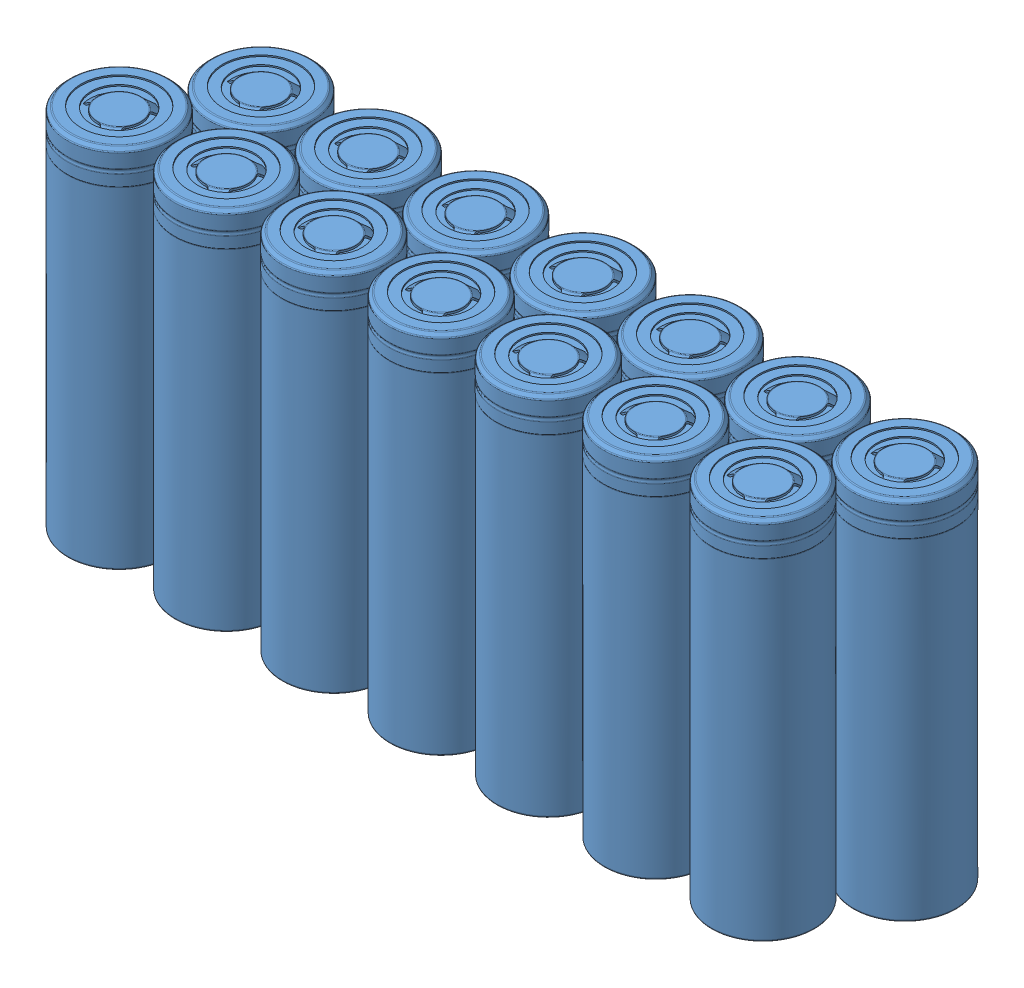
SolidWorks assembly 18650-6s2p_Staggered_v1.SLDASM, configuration Default (file format 12000). Lengths in mm.
Overall size (143.13 64.95 34.95).
14 component instances, 1 part files, 3 mates.
Components (placement in the parent):
- Samsung INR18650-29R-1: Samsung INR18650-29R.SLDPRT [Standard] at (12.9292 41.5757 50.6069) size (18.38 64.95 18.38)
- Samsung INR18650-29R-4: Samsung INR18650-29R.SLDPRT [Standard] at (31.9792 41.5757 50.6069) size (18.38 64.95 18.38)
- Samsung INR18650-29R-5: Samsung INR18650-29R.SLDPRT [Standard] at (51.0292 41.5757 50.6069) size (18.38 64.95 18.38)
- Samsung INR18650-29R-6: Samsung INR18650-29R.SLDPRT [Standard] at (70.0792 41.5757 50.6069) size (18.38 64.95 18.38)
- Samsung INR18650-29R-7: Samsung INR18650-29R.SLDPRT [Standard] at (89.1292 41.5757 50.6069) size (18.38 64.95 18.38)
- Samsung INR18650-29R-8: Samsung INR18650-29R.SLDPRT [Standard] at (108.1792 41.5757 50.6069) size (18.38 64.95 18.38)
- Samsung INR18650-29R-14: Samsung INR18650-29R.SLDPRT [Standard] at (22.4542 41.5757 34.9577) x (0.994386 0 0.105813) z (-0.105813 0 0.994386) size (18.38 64.95 18.38)
- Samsung INR18650-29R-15: Samsung INR18650-29R.SLDPRT [Standard] at (41.5042 41.5757 34.9577) x (0.994386 0 0.105813) z (-0.105813 0 0.994386) size (18.38 64.95 18.38)
- Samsung INR18650-29R-16: Samsung INR18650-29R.SLDPRT [Standard] at (60.5542 41.5757 34.9577) x (0.994386 0 0.105813) z (-0.105813 0 0.994386) size (18.38 64.95 18.38)
- Samsung INR18650-29R-17: Samsung INR18650-29R.SLDPRT [Standard] at (79.6042 41.5757 34.9577) x (0.994386 0 0.105813) z (-0.105813 0 0.994386) size (18.38 64.95 18.38)
- Samsung INR18650-29R-18: Samsung INR18650-29R.SLDPRT [Standard] at (98.6542 41.5757 34.9577) x (0.994386 0 0.105813) z (-0.105813 0 0.994386) size (18.38 64.95 18.38)
- Samsung INR18650-29R-19: Samsung INR18650-29R.SLDPRT [Standard] at (117.7042 41.5757 34.9577) x (0.994386 0 0.105813) z (-0.105813 0 0.994386) size (18.38 64.95 18.38)
- Samsung INR18650-29R-20: Samsung INR18650-29R.SLDPRT [Standard] at (127.2292 41.5757 50.6069) size (18.38 64.95 18.38)
- Samsung INR18650-29R-21: Samsung INR18650-29R.SLDPRT [Standard] at (136.7542 41.5757 34.9577) x (0.994386 0 0.105813) z (-0.105813 0 0.994386) size (18.38 64.95 18.38)
Mates (geometry in assembly coordinates):
- Tangent1: tangent anti-aligned: cylinder of Samsung INR18650-29R-1 through (12.9292 108.1724 50.6069) axis (0 1 0) radius 9.16; cylinder of Samsung INR18650-29R-14 through (22.4542 108.1724 34.9577) axis (0 1 0) radius 9.16
- Coincident1: coincident aligned: plane of Samsung INR18650-29R-1 through (12.9292 79.1996 50.6069) normal (0 1 0); plane of Samsung INR18650-29R-14 through (22.4542 79.1996 34.9577) normal (0 1 0)
- Tangent2: tangent anti-aligned: cylinder of Samsung INR18650-29R-4 through (31.9792 108.1724 50.6069) axis (0 1 0) radius 9.16; cylinder of Samsung INR18650-29R-14 through (22.4542 108.1724 34.9577) axis (0 1 0) radius 9.16
